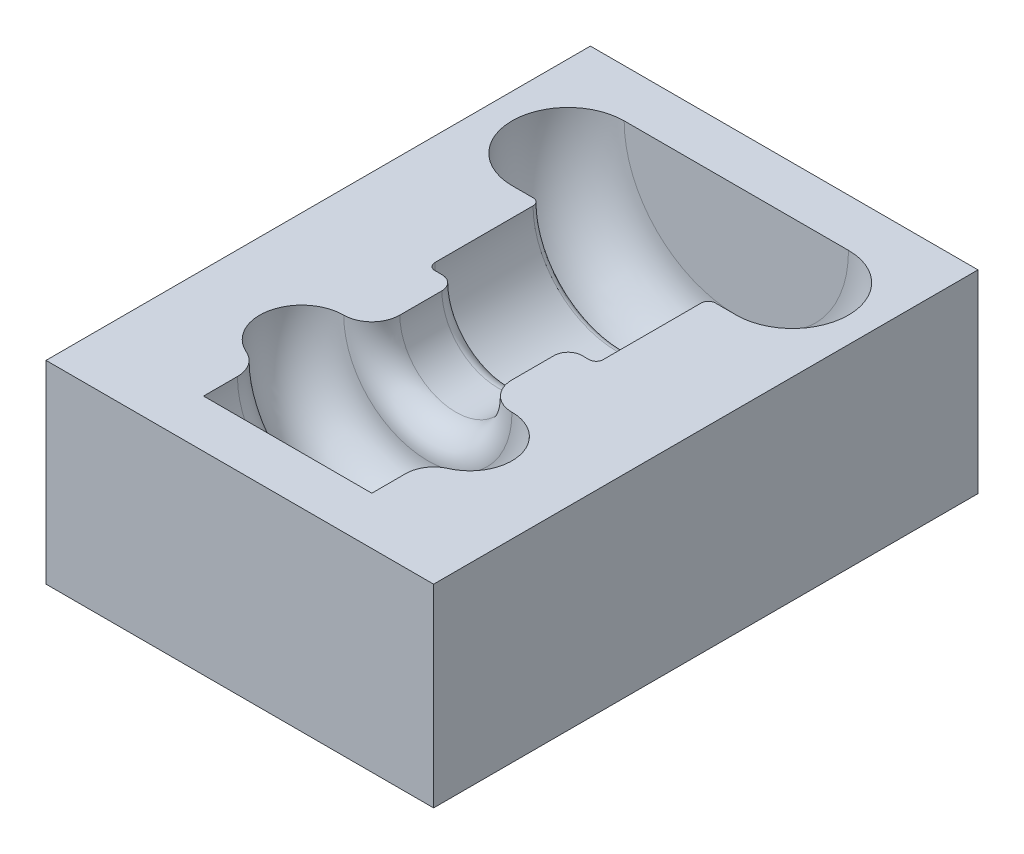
ISO-10303-21;
HEADER;
FILE_DESCRIPTION(('STEP AP214'),'2;1');
FILE_NAME('part.step','',(''),(''),'','','');
FILE_SCHEMA(('AUTOMOTIVE_DESIGN { 1 0 10303 214 1 1 1 1 }'));
ENDSEC;
DATA;
#1=APPLICATION_CONTEXT('core data for automotive mechanical design processes');
#2=APPLICATION_PROTOCOL_DEFINITION('international standard','automotive_design',2000,#1);
#3=PRODUCT_CONTEXT('',#1,'mechanical');
#4=PRODUCT('Part','Part','',(#3));
#5=PRODUCT_RELATED_PRODUCT_CATEGORY('part','',(#4));
#6=PRODUCT_DEFINITION_FORMATION('','',#4);
#7=PRODUCT_DEFINITION_CONTEXT('part definition',#1,'design');
#8=PRODUCT_DEFINITION('design','',#6,#7);
#9=PRODUCT_DEFINITION_SHAPE('','',#8);
#10=(LENGTH_UNIT() NAMED_UNIT(*) SI_UNIT(.MILLI.,.METRE.));
#11=(NAMED_UNIT(*) PLANE_ANGLE_UNIT() SI_UNIT($,.RADIAN.));
#12=(NAMED_UNIT(*) SI_UNIT($,.STERADIAN.) SOLID_ANGLE_UNIT());
#13=UNCERTAINTY_MEASURE_WITH_UNIT(LENGTH_MEASURE(1.E-05),#10,'distance_accuracy_value','');
#14=(GEOMETRIC_REPRESENTATION_CONTEXT(3) GLOBAL_UNCERTAINTY_ASSIGNED_CONTEXT((#13)) GLOBAL_UNIT_ASSIGNED_CONTEXT((#10,
#11,#12)) REPRESENTATION_CONTEXT('',''));
#15=CARTESIAN_POINT('',(0.,0.,0.));
#16=DIRECTION('',(0.,0.,1.));
#17=DIRECTION('',(1.,0.,0.));
#18=AXIS2_PLACEMENT_3D('',#15,#16,#17);
#19=CARTESIAN_POINT('',(-71.2,0.,-100.01));
#20=DIRECTION('',(0.,-1.,0.));
#21=DIRECTION('',(0.,0.,-1.));
#22=AXIS2_PLACEMENT_3D('',#19,#20,#21);
#23=PLANE('',#22);
#24=DIRECTION('',(-1.,0.,0.));
#25=VECTOR('',#24,1.);
#26=CARTESIAN_POINT('',(0.,0.,-100.));
#27=LINE('',#26,#25);
#28=CARTESIAN_POINT('',(71.2,0.,-100.));
#29=VERTEX_POINT('',#28);
#30=CARTESIAN_POINT('',(-71.2,0.,-100.));
#31=VERTEX_POINT('',#30);
#32=EDGE_CURVE('E35',#29,#31,#27,.T.);
#33=ORIENTED_EDGE('',*,*,#32,.T.);
#34=DIRECTION('',(0.,0.,-1.));
#35=VECTOR('',#34,1.);
#36=CARTESIAN_POINT('',(-71.2,0.,100.));
#37=LINE('',#36,#35);
#38=CARTESIAN_POINT('',(-71.2,0.,100.));
#39=VERTEX_POINT('',#38);
#40=EDGE_CURVE('E191',#39,#31,#37,.T.);
#41=ORIENTED_EDGE('',*,*,#40,.F.);
#42=DIRECTION('',(-1.,0.,0.));
#43=VECTOR('',#42,1.);
#44=CARTESIAN_POINT('',(0.,0.,100.));
#45=LINE('',#44,#43);
#46=CARTESIAN_POINT('',(71.2,0.,100.));
#47=VERTEX_POINT('',#46);
#48=EDGE_CURVE('E159',#47,#39,#45,.T.);
#49=ORIENTED_EDGE('',*,*,#48,.F.);
#50=DIRECTION('',(0.,0.,1.));
#51=VECTOR('',#50,1.);
#52=CARTESIAN_POINT('',(71.2,0.,100.));
#53=LINE('',#52,#51);
#54=EDGE_CURVE('E194',#29,#47,#53,.T.);
#55=ORIENTED_EDGE('',*,*,#54,.F.);
#56=EDGE_LOOP('',(#33,#41,#49,#55));
#57=FACE_BOUND('',#56,.T.);
#58=CARTESIAN_POINT('',(41.208,0.,-61.812));
#59=DIRECTION('',(0.,-1.,0.));
#60=DIRECTION('',(0.,0.,-1.));
#61=AXIS2_PLACEMENT_3D('',#58,#59,#60);
#62=CIRCLE('',#61,20.604);
#63=CARTESIAN_POINT('',(41.208,0.,-82.416));
#64=VERTEX_POINT('',#63);
#65=CARTESIAN_POINT('',(41.208,0.,-41.208));
#66=VERTEX_POINT('',#65);
#67=EDGE_CURVE('E231',#64,#66,#62,.T.);
#68=ORIENTED_EDGE('',*,*,#67,.T.);
#69=DIRECTION('',(-1.,0.,0.));
#70=VECTOR('',#69,1.);
#71=CARTESIAN_POINT('',(0.,0.,-41.208));
#72=LINE('',#71,#70);
#73=CARTESIAN_POINT('',(33.4815,0.,-41.208));
#74=VERTEX_POINT('',#73);
#75=EDGE_CURVE('E227',#66,#74,#72,.T.);
#76=ORIENTED_EDGE('',*,*,#75,.T.);
#77=CARTESIAN_POINT('',(33.4815,0.,-38.6325));
#78=DIRECTION('',(0.,-1.,0.));
#79=DIRECTION('',(0.,0.,-1.));
#80=AXIS2_PLACEMENT_3D('',#77,#78,#79);
#81=CIRCLE('',#80,2.5755);
#82=CARTESIAN_POINT('',(30.906,0.,-38.6325));
#83=VERTEX_POINT('',#82);
#84=EDGE_CURVE('E192',#83,#74,#81,.T.);
#85=ORIENTED_EDGE('',*,*,#84,.F.);
#86=DIRECTION('',(0.,0.,1.));
#87=VECTOR('',#86,1.);
#88=CARTESIAN_POINT('',(30.906,0.,82.416));
#89=LINE('',#88,#87);
#90=CARTESIAN_POINT('',(30.906,0.,-2.57550000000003));
#91=VERTEX_POINT('',#90);
#92=EDGE_CURVE('E221',#91,#83,#89,.F.);
#93=ORIENTED_EDGE('',*,*,#92,.F.);
#94=CARTESIAN_POINT('',(28.3305,0.,-2.57550000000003));
#95=DIRECTION('',(0.,-1.,0.));
#96=DIRECTION('',(0.,0.,-1.));
#97=AXIS2_PLACEMENT_3D('',#94,#95,#96);
#98=CIRCLE('',#97,2.5755);
#99=CARTESIAN_POINT('',(28.3305,0.,0.));
#100=VERTEX_POINT('',#99);
#101=EDGE_CURVE('E218',#91,#100,#98,.T.);
#102=ORIENTED_EDGE('',*,*,#101,.T.);
#103=DIRECTION('',(-1.,0.,0.));
#104=VECTOR('',#103,1.);
#105=CARTESIAN_POINT('',(0.,0.,0.));
#106=LINE('',#105,#104);
#107=CARTESIAN_POINT('',(25.755,0.,0.));
#108=VERTEX_POINT('',#107);
#109=EDGE_CURVE('E214',#100,#108,#106,.T.);
#110=ORIENTED_EDGE('',*,*,#109,.T.);
#111=CARTESIAN_POINT('',(25.755,0.,5.15099999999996));
#112=DIRECTION('',(0.,-1.,0.));
#113=DIRECTION('',(0.,0.,-1.));
#114=AXIS2_PLACEMENT_3D('',#111,#112,#113);
#115=CIRCLE('',#114,5.151);
#116=CARTESIAN_POINT('',(20.604,0.,5.15099999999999));
#117=VERTEX_POINT('',#116);
#118=EDGE_CURVE('E210',#117,#108,#115,.T.);
#119=ORIENTED_EDGE('',*,*,#118,.F.);
#120=DIRECTION('',(0.,0.,1.));
#121=VECTOR('',#120,1.);
#122=CARTESIAN_POINT('',(20.604,0.,82.416));
#123=LINE('',#122,#121);
#124=CARTESIAN_POINT('',(20.604,0.,20.604));
#125=VERTEX_POINT('',#124);
#126=EDGE_CURVE('E207',#117,#125,#123,.T.);
#127=ORIENTED_EDGE('',*,*,#126,.T.);
#128=CARTESIAN_POINT('',(30.906,0.,20.604));
#129=DIRECTION('',(0.,-1.,0.));
#130=DIRECTION('',(0.,0.,-1.));
#131=AXIS2_PLACEMENT_3D('',#128,#129,#130);
#132=CIRCLE('',#131,10.302);
#133=CARTESIAN_POINT('',(30.906,0.,30.906));
#134=VERTEX_POINT('',#133);
#135=EDGE_CURVE('E203',#134,#125,#132,.T.);
#136=ORIENTED_EDGE('',*,*,#135,.F.);
#137=CARTESIAN_POINT('',(30.906,0.,46.359));
#138=DIRECTION('',(0.,-1.,0.));
#139=DIRECTION('',(0.,0.,-1.));
#140=AXIS2_PLACEMENT_3D('',#137,#138,#139);
#141=CIRCLE('',#140,15.453);
#142=CARTESIAN_POINT('',(37.0872,0.,60.5219084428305));
#143=VERTEX_POINT('',#142);
#144=EDGE_CURVE('E200',#134,#143,#141,.T.);
#145=ORIENTED_EDGE('',*,*,#144,.T.);
#146=CARTESIAN_POINT('',(41.208,0.,69.9638474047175));
#147=DIRECTION('',(0.,-1.,0.));
#148=DIRECTION('',(0.,0.,-1.));
#149=AXIS2_PLACEMENT_3D('',#146,#147,#148);
#150=CIRCLE('',#149,10.302);
#151=CARTESIAN_POINT('',(30.906,0.,69.9638474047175));
#152=VERTEX_POINT('',#151);
#153=EDGE_CURVE('E197',#152,#143,#150,.T.);
#154=ORIENTED_EDGE('',*,*,#153,.F.);
#155=DIRECTION('',(0.,0.,1.));
#156=VECTOR('',#155,1.);
#157=CARTESIAN_POINT('',(30.906,0.,82.416));
#158=LINE('',#157,#156);
#159=CARTESIAN_POINT('',(30.906,0.,82.416));
#160=VERTEX_POINT('',#159);
#161=EDGE_CURVE('E40',#152,#160,#158,.T.);
#162=ORIENTED_EDGE('',*,*,#161,.T.);
#163=DIRECTION('',(-1.,0.,0.));
#164=VECTOR('',#163,1.);
#165=CARTESIAN_POINT('',(0.,0.,82.416));
#166=LINE('',#165,#164);
#167=CARTESIAN_POINT('',(-30.906,0.,82.416));
#168=VERTEX_POINT('',#167);
#169=EDGE_CURVE('E47',#160,#168,#166,.T.);
#170=ORIENTED_EDGE('',*,*,#169,.T.);
#171=DIRECTION('',(0.,0.,1.));
#172=VECTOR('',#171,1.);
#173=CARTESIAN_POINT('',(-30.906,0.,82.416));
#174=LINE('',#173,#172);
#175=CARTESIAN_POINT('',(-30.906,0.,69.9638474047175));
#176=VERTEX_POINT('',#175);
#177=EDGE_CURVE('E11',#168,#176,#174,.F.);
#178=ORIENTED_EDGE('',*,*,#177,.T.);
#179=CARTESIAN_POINT('',(-41.208,0.,69.9638474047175));
#180=DIRECTION('',(0.,-1.,0.));
#181=DIRECTION('',(0.,0.,-1.));
#182=AXIS2_PLACEMENT_3D('',#179,#180,#181);
#183=CIRCLE('',#182,10.302);
#184=CARTESIAN_POINT('',(-37.0872,0.,60.5219084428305));
#185=VERTEX_POINT('',#184);
#186=EDGE_CURVE('E171',#185,#176,#183,.T.);
#187=ORIENTED_EDGE('',*,*,#186,.F.);
#188=CARTESIAN_POINT('',(-30.906,0.,46.359));
#189=DIRECTION('',(0.,-1.,0.));
#190=DIRECTION('',(0.,0.,-1.));
#191=AXIS2_PLACEMENT_3D('',#188,#189,#190);
#192=CIRCLE('',#191,15.453);
#193=CARTESIAN_POINT('',(-30.906,0.,30.906));
#194=VERTEX_POINT('',#193);
#195=EDGE_CURVE('E189',#185,#194,#192,.T.);
#196=ORIENTED_EDGE('',*,*,#195,.T.);
#197=CARTESIAN_POINT('',(-30.906,0.,20.604));
#198=DIRECTION('',(0.,-1.,0.));
#199=DIRECTION('',(0.,0.,-1.));
#200=AXIS2_PLACEMENT_3D('',#197,#198,#199);
#201=CIRCLE('',#200,10.302);
#202=CARTESIAN_POINT('',(-20.604,0.,20.604));
#203=VERTEX_POINT('',#202);
#204=EDGE_CURVE('E201',#203,#194,#201,.T.);
#205=ORIENTED_EDGE('',*,*,#204,.F.);
#206=DIRECTION('',(0.,0.,1.));
#207=VECTOR('',#206,1.);
#208=CARTESIAN_POINT('',(-20.604,0.,82.416));
#209=LINE('',#208,#207);
#210=CARTESIAN_POINT('',(-20.604,0.,5.15099999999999));
#211=VERTEX_POINT('',#210);
#212=EDGE_CURVE('E204',#203,#211,#209,.F.);
#213=ORIENTED_EDGE('',*,*,#212,.T.);
#214=CARTESIAN_POINT('',(-25.755,0.,5.15099999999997));
#215=DIRECTION('',(0.,-1.,0.));
#216=DIRECTION('',(0.,0.,-1.));
#217=AXIS2_PLACEMENT_3D('',#214,#215,#216);
#218=CIRCLE('',#217,5.151);
#219=CARTESIAN_POINT('',(-25.755,0.,0.));
#220=VERTEX_POINT('',#219);
#221=EDGE_CURVE('E208',#220,#211,#218,.T.);
#222=ORIENTED_EDGE('',*,*,#221,.F.);
#223=CARTESIAN_POINT('',(-28.3305,0.,0.));
#224=VERTEX_POINT('',#223);
#225=EDGE_CURVE('E211',#220,#224,#106,.T.);
#226=ORIENTED_EDGE('',*,*,#225,.T.);
#227=CARTESIAN_POINT('',(-28.3305,0.,-2.57550000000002));
#228=DIRECTION('',(0.,-1.,0.));
#229=DIRECTION('',(0.,0.,-1.));
#230=AXIS2_PLACEMENT_3D('',#227,#228,#229);
#231=CIRCLE('',#230,2.5755);
#232=CARTESIAN_POINT('',(-30.906,0.,-2.57550000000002));
#233=VERTEX_POINT('',#232);
#234=EDGE_CURVE('E215',#224,#233,#231,.T.);
#235=ORIENTED_EDGE('',*,*,#234,.T.);
#236=DIRECTION('',(0.,0.,1.));
#237=VECTOR('',#236,1.);
#238=CARTESIAN_POINT('',(-30.906,0.,82.416));
#239=LINE('',#238,#237);
#240=CARTESIAN_POINT('',(-30.906,0.,-38.6325));
#241=VERTEX_POINT('',#240);
#242=EDGE_CURVE('E219',#241,#233,#239,.T.);
#243=ORIENTED_EDGE('',*,*,#242,.F.);
#244=CARTESIAN_POINT('',(-33.4815,0.,-38.6325));
#245=DIRECTION('',(0.,-1.,0.));
#246=DIRECTION('',(0.,0.,-1.));
#247=AXIS2_PLACEMENT_3D('',#244,#245,#246);
#248=CIRCLE('',#247,2.5755);
#249=CARTESIAN_POINT('',(-33.4815,0.,-41.208));
#250=VERTEX_POINT('',#249);
#251=EDGE_CURVE('E222',#250,#241,#248,.T.);
#252=ORIENTED_EDGE('',*,*,#251,.F.);
#253=CARTESIAN_POINT('',(-41.208,0.,-41.208));
#254=VERTEX_POINT('',#253);
#255=EDGE_CURVE('E224',#250,#254,#72,.T.);
#256=ORIENTED_EDGE('',*,*,#255,.T.);
#257=CARTESIAN_POINT('',(-41.208,0.,-61.812));
#258=DIRECTION('',(0.,-1.,0.));
#259=DIRECTION('',(0.,0.,-1.));
#260=AXIS2_PLACEMENT_3D('',#257,#258,#259);
#261=CIRCLE('',#260,20.604);
#262=CARTESIAN_POINT('',(-41.208,0.,-82.416));
#263=VERTEX_POINT('',#262);
#264=EDGE_CURVE('E228',#254,#263,#261,.T.);
#265=ORIENTED_EDGE('',*,*,#264,.T.);
#266=DIRECTION('',(1.,0.,0.));
#267=VECTOR('',#266,1.);
#268=CARTESIAN_POINT('',(0.,0.,-82.416));
#269=LINE('',#268,#267);
#270=EDGE_CURVE('E232',#263,#64,#269,.T.);
#271=ORIENTED_EDGE('',*,*,#270,.T.);
#272=EDGE_LOOP('',(#68,#76,#85,#93,#102,#110,#119,#127,#136,#145,#154,#162,#170,#178,#187,#196,
#205,#213,#222,#226,#235,#243,#252,#256,#265,#271));
#273=FACE_BOUND('',#272,.T.);
#274=ADVANCED_FACE('F32',(#57,#273),#23,.F.);
#275=CARTESIAN_POINT('',(0.,0.,82.416));
#276=DIRECTION('',(0.,0.,-1.));
#277=DIRECTION('',(-1.,0.,0.));
#278=AXIS2_PLACEMENT_3D('',#275,#276,#277);
#279=PLANE('',#278);
#280=ORIENTED_EDGE('',*,*,#169,.F.);
#281=CARTESIAN_POINT('',(0.,0.,82.416));
#282=DIRECTION('',(0.,0.,1.));
#283=DIRECTION('',(1.,0.,0.));
#284=AXIS2_PLACEMENT_3D('',#281,#282,#283);
#285=CIRCLE('',#284,30.906);
#286=EDGE_CURVE('E342',#168,#160,#285,.T.);
#287=ORIENTED_EDGE('',*,*,#286,.F.);
#288=EDGE_LOOP('',(#280,#287));
#289=FACE_BOUND('',#288,.T.);
#290=ADVANCED_FACE('F281',(#289),#279,.T.);
#291=CARTESIAN_POINT('',(0.,0.,-82.416));
#292=DIRECTION('',(0.,0.,1.));
#293=DIRECTION('',(1.,0.,0.));
#294=AXIS2_PLACEMENT_3D('',#291,#292,#293);
#295=PLANE('',#294);
#296=ORIENTED_EDGE('',*,*,#270,.F.);
#297=CARTESIAN_POINT('',(0.,0.,-82.416));
#298=DIRECTION('',(0.,0.,1.));
#299=DIRECTION('',(1.,0.,0.));
#300=AXIS2_PLACEMENT_3D('',#297,#298,#299);
#301=CIRCLE('',#300,41.208);
#302=EDGE_CURVE('E184',#263,#64,#301,.T.);
#303=ORIENTED_EDGE('',*,*,#302,.T.);
#304=EDGE_LOOP('',(#296,#303));
#305=FACE_BOUND('',#304,.T.);
#306=ADVANCED_FACE('F285',(#305),#295,.T.);
#307=CARTESIAN_POINT('',(0.,0.,-61.812));
#308=DIRECTION('',(0.,0.,1.));
#309=DIRECTION('',(1.,0.,0.));
#310=AXIS2_PLACEMENT_3D('',#307,#308,#309);
#311=TOROIDAL_SURFACE('',#310,41.208,20.604);
#312=ORIENTED_EDGE('',*,*,#67,.F.);
#313=ORIENTED_EDGE('',*,*,#302,.F.);
#314=ORIENTED_EDGE('',*,*,#264,.F.);
#315=CARTESIAN_POINT('',(0.,0.,-41.208));
#316=DIRECTION('',(0.,0.,1.));
#317=DIRECTION('',(1.,0.,0.));
#318=AXIS2_PLACEMENT_3D('',#315,#316,#317);
#319=CIRCLE('',#318,41.208);
#320=EDGE_CURVE('E256',#254,#66,#319,.T.);
#321=ORIENTED_EDGE('',*,*,#320,.T.);
#322=EDGE_LOOP('',(#312,#313,#314,#321));
#323=FACE_BOUND('',#322,.T.);
#324=ADVANCED_FACE('F257',(#323),#311,.F.);
#325=CARTESIAN_POINT('',(0.,0.,-41.208));
#326=DIRECTION('',(0.,0.,-1.));
#327=DIRECTION('',(-1.,0.,0.));
#328=AXIS2_PLACEMENT_3D('',#325,#326,#327);
#329=PLANE('',#328);
#330=ORIENTED_EDGE('',*,*,#75,.F.);
#331=ORIENTED_EDGE('',*,*,#320,.F.);
#332=ORIENTED_EDGE('',*,*,#255,.F.);
#333=CARTESIAN_POINT('',(0.,0.,-41.208));
#334=DIRECTION('',(0.,0.,1.));
#335=DIRECTION('',(1.,0.,0.));
#336=AXIS2_PLACEMENT_3D('',#333,#334,#335);
#337=CIRCLE('',#336,33.4815);
#338=EDGE_CURVE('E259',#250,#74,#337,.T.);
#339=ORIENTED_EDGE('',*,*,#338,.T.);
#340=EDGE_LOOP('',(#330,#331,#332,#339));
#341=FACE_BOUND('',#340,.T.);
#342=ADVANCED_FACE('F295',(#341),#329,.T.);
#343=CARTESIAN_POINT('',(0.,0.,-38.6325));
#344=DIRECTION('',(0.,0.,1.));
#345=DIRECTION('',(1.,0.,0.));
#346=AXIS2_PLACEMENT_3D('',#343,#344,#345);
#347=TOROIDAL_SURFACE('',#346,33.4815,2.5755);
#348=CARTESIAN_POINT('',(0.,0.,-38.6325));
#349=DIRECTION('',(0.,0.,1.));
#350=DIRECTION('',(1.,0.,0.));
#351=AXIS2_PLACEMENT_3D('',#348,#349,#350);
#352=CIRCLE('',#351,30.906);
#353=EDGE_CURVE('E262',#241,#83,#352,.T.);
#354=ORIENTED_EDGE('',*,*,#353,.T.);
#355=ORIENTED_EDGE('',*,*,#84,.T.);
#356=ORIENTED_EDGE('',*,*,#338,.F.);
#357=ORIENTED_EDGE('',*,*,#251,.T.);
#358=EDGE_LOOP('',(#354,#355,#356,#357));
#359=FACE_BOUND('',#358,.T.);
#360=ADVANCED_FACE('F298',(#359),#347,.T.);
#361=CARTESIAN_POINT('',(0.,0.,82.416));
#362=DIRECTION('',(0.,0.,1.));
#363=DIRECTION('',(1.,0.,0.));
#364=AXIS2_PLACEMENT_3D('',#361,#362,#363);
#365=CYLINDRICAL_SURFACE('',#364,30.906);
#366=CARTESIAN_POINT('',(0.,0.,-2.57550000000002));
#367=DIRECTION('',(0.,0.,1.));
#368=DIRECTION('',(1.,0.,0.));
#369=AXIS2_PLACEMENT_3D('',#366,#367,#368);
#370=CIRCLE('',#369,30.906);
#371=EDGE_CURVE('E367',#233,#91,#370,.T.);
#372=ORIENTED_EDGE('',*,*,#371,.T.);
#373=ORIENTED_EDGE('',*,*,#92,.T.);
#374=ORIENTED_EDGE('',*,*,#353,.F.);
#375=ORIENTED_EDGE('',*,*,#242,.T.);
#376=EDGE_LOOP('',(#372,#373,#374,#375));
#377=FACE_BOUND('',#376,.T.);
#378=ADVANCED_FACE('F301',(#377),#365,.F.);
#379=CARTESIAN_POINT('',(0.,0.,-2.57550000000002));
#380=DIRECTION('',(0.,0.,1.));
#381=DIRECTION('',(1.,0.,0.));
#382=AXIS2_PLACEMENT_3D('',#379,#380,#381);
#383=TOROIDAL_SURFACE('',#382,28.3305,2.5755);
#384=ORIENTED_EDGE('',*,*,#101,.F.);
#385=ORIENTED_EDGE('',*,*,#371,.F.);
#386=ORIENTED_EDGE('',*,*,#234,.F.);
#387=CARTESIAN_POINT('',(0.,0.,0.));
#388=DIRECTION('',(0.,0.,1.));
#389=DIRECTION('',(1.,0.,0.));
#390=AXIS2_PLACEMENT_3D('',#387,#388,#389);
#391=CIRCLE('',#390,28.3305);
#392=EDGE_CURVE('E364',#224,#100,#391,.T.);
#393=ORIENTED_EDGE('',*,*,#392,.T.);
#394=EDGE_LOOP('',(#384,#385,#386,#393));
#395=FACE_BOUND('',#394,.T.);
#396=ADVANCED_FACE('F305',(#395),#383,.F.);
#397=CARTESIAN_POINT('',(0.,0.,0.));
#398=DIRECTION('',(0.,0.,-1.));
#399=DIRECTION('',(-1.,0.,0.));
#400=AXIS2_PLACEMENT_3D('',#397,#398,#399);
#401=PLANE('',#400);
#402=ORIENTED_EDGE('',*,*,#109,.F.);
#403=ORIENTED_EDGE('',*,*,#392,.F.);
#404=ORIENTED_EDGE('',*,*,#225,.F.);
#405=CARTESIAN_POINT('',(0.,0.,0.));
#406=DIRECTION('',(0.,0.,1.));
#407=DIRECTION('',(1.,0.,0.));
#408=AXIS2_PLACEMENT_3D('',#405,#406,#407);
#409=CIRCLE('',#408,25.755);
#410=EDGE_CURVE('E361',#220,#108,#409,.T.);
#411=ORIENTED_EDGE('',*,*,#410,.T.);
#412=EDGE_LOOP('',(#402,#403,#404,#411));
#413=FACE_BOUND('',#412,.T.);
#414=ADVANCED_FACE('F309',(#413),#401,.T.);
#415=CARTESIAN_POINT('',(0.,0.,5.15099999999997));
#416=DIRECTION('',(0.,0.,1.));
#417=DIRECTION('',(1.,0.,0.));
#418=AXIS2_PLACEMENT_3D('',#415,#416,#417);
#419=TOROIDAL_SURFACE('',#418,25.755,5.151);
#420=CARTESIAN_POINT('',(0.,0.,5.15099999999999));
#421=DIRECTION('',(0.,0.,1.));
#422=DIRECTION('',(1.,0.,0.));
#423=AXIS2_PLACEMENT_3D('',#420,#421,#422);
#424=CIRCLE('',#423,20.604);
#425=EDGE_CURVE('E358',#211,#117,#424,.T.);
#426=ORIENTED_EDGE('',*,*,#425,.T.);
#427=ORIENTED_EDGE('',*,*,#118,.T.);
#428=ORIENTED_EDGE('',*,*,#410,.F.);
#429=ORIENTED_EDGE('',*,*,#221,.T.);
#430=EDGE_LOOP('',(#426,#427,#428,#429));
#431=FACE_BOUND('',#430,.T.);
#432=ADVANCED_FACE('F313',(#431),#419,.T.);
#433=CARTESIAN_POINT('',(0.,0.,82.416));
#434=DIRECTION('',(0.,0.,1.));
#435=DIRECTION('',(1.,0.,0.));
#436=AXIS2_PLACEMENT_3D('',#433,#434,#435);
#437=CYLINDRICAL_SURFACE('',#436,20.604);
#438=ORIENTED_EDGE('',*,*,#126,.F.);
#439=ORIENTED_EDGE('',*,*,#425,.F.);
#440=ORIENTED_EDGE('',*,*,#212,.F.);
#441=CARTESIAN_POINT('',(0.,0.,20.604));
#442=DIRECTION('',(0.,0.,1.));
#443=DIRECTION('',(1.,0.,0.));
#444=AXIS2_PLACEMENT_3D('',#441,#442,#443);
#445=CIRCLE('',#444,20.604);
#446=EDGE_CURVE('E355',#203,#125,#445,.T.);
#447=ORIENTED_EDGE('',*,*,#446,.T.);
#448=EDGE_LOOP('',(#438,#439,#440,#447));
#449=FACE_BOUND('',#448,.T.);
#450=ADVANCED_FACE('F317',(#449),#437,.F.);
#451=CARTESIAN_POINT('',(0.,0.,20.604));
#452=DIRECTION('',(0.,0.,1.));
#453=DIRECTION('',(1.,0.,0.));
#454=AXIS2_PLACEMENT_3D('',#451,#452,#453);
#455=TOROIDAL_SURFACE('',#454,30.906,10.302);
#456=CARTESIAN_POINT('',(0.,0.,30.906));
#457=DIRECTION('',(0.,0.,1.));
#458=DIRECTION('',(1.,0.,0.));
#459=AXIS2_PLACEMENT_3D('',#456,#457,#458);
#460=CIRCLE('',#459,30.906);
#461=EDGE_CURVE('E349',#194,#134,#460,.T.);
#462=ORIENTED_EDGE('',*,*,#461,.T.);
#463=ORIENTED_EDGE('',*,*,#135,.T.);
#464=ORIENTED_EDGE('',*,*,#446,.F.);
#465=ORIENTED_EDGE('',*,*,#204,.T.);
#466=EDGE_LOOP('',(#462,#463,#464,#465));
#467=FACE_BOUND('',#466,.T.);
#468=ADVANCED_FACE('F321',(#467),#455,.T.);
#469=CARTESIAN_POINT('',(0.,0.,46.359));
#470=DIRECTION('',(0.,0.,1.));
#471=DIRECTION('',(1.,0.,0.));
#472=AXIS2_PLACEMENT_3D('',#469,#470,#471);
#473=TOROIDAL_SURFACE('',#472,30.906,15.453);
#474=ORIENTED_EDGE('',*,*,#144,.F.);
#475=ORIENTED_EDGE('',*,*,#461,.F.);
#476=ORIENTED_EDGE('',*,*,#195,.F.);
#477=CARTESIAN_POINT('',(0.,0.,60.5219084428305));
#478=DIRECTION('',(0.,0.,1.));
#479=DIRECTION('',(1.,0.,0.));
#480=AXIS2_PLACEMENT_3D('',#477,#478,#479);
#481=CIRCLE('',#480,37.0872);
#482=EDGE_CURVE('E347',#185,#143,#481,.T.);
#483=ORIENTED_EDGE('',*,*,#482,.T.);
#484=EDGE_LOOP('',(#474,#475,#476,#483));
#485=FACE_BOUND('',#484,.T.);
#486=ADVANCED_FACE('F325',(#485),#473,.F.);
#487=CARTESIAN_POINT('',(0.,0.,69.9638474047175));
#488=DIRECTION('',(0.,0.,1.));
#489=DIRECTION('',(1.,0.,0.));
#490=AXIS2_PLACEMENT_3D('',#487,#488,#489);
#491=TOROIDAL_SURFACE('',#490,41.208,10.302);
#492=CARTESIAN_POINT('',(0.,0.,69.9638474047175));
#493=DIRECTION('',(0.,0.,1.));
#494=DIRECTION('',(1.,0.,0.));
#495=AXIS2_PLACEMENT_3D('',#492,#493,#494);
#496=CIRCLE('',#495,30.906);
#497=EDGE_CURVE('E341',#176,#152,#496,.T.);
#498=ORIENTED_EDGE('',*,*,#497,.T.);
#499=ORIENTED_EDGE('',*,*,#153,.T.);
#500=ORIENTED_EDGE('',*,*,#482,.F.);
#501=ORIENTED_EDGE('',*,*,#186,.T.);
#502=EDGE_LOOP('',(#498,#499,#500,#501));
#503=FACE_BOUND('',#502,.T.);
#504=ADVANCED_FACE('F329',(#503),#491,.T.);
#505=CARTESIAN_POINT('',(0.,0.,82.416));
#506=DIRECTION('',(0.,0.,1.));
#507=DIRECTION('',(1.,0.,0.));
#508=AXIS2_PLACEMENT_3D('',#505,#506,#507);
#509=CYLINDRICAL_SURFACE('',#508,30.906);
#510=ORIENTED_EDGE('',*,*,#161,.F.);
#511=ORIENTED_EDGE('',*,*,#497,.F.);
#512=ORIENTED_EDGE('',*,*,#177,.F.);
#513=ORIENTED_EDGE('',*,*,#286,.T.);
#514=EDGE_LOOP('',(#510,#511,#512,#513));
#515=FACE_BOUND('',#514,.T.);
#516=ADVANCED_FACE('F333',(#515),#509,.F.);
#517=CARTESIAN_POINT('',(71.2,-71.2,100.));
#518=DIRECTION('',(-1.,0.,0.));
#519=DIRECTION('',(0.,0.,1.));
#520=AXIS2_PLACEMENT_3D('',#517,#518,#519);
#521=PLANE('',#520);
#522=DIRECTION('',(0.,1.,0.));
#523=VECTOR('',#522,1.);
#524=CARTESIAN_POINT('',(71.2,-71.2,-100.));
#525=LINE('',#524,#523);
#526=CARTESIAN_POINT('',(71.2,-71.2,-100.));
#527=VERTEX_POINT('',#526);
#528=EDGE_CURVE('E181',#527,#29,#525,.T.);
#529=ORIENTED_EDGE('',*,*,#528,.T.);
#530=ORIENTED_EDGE('',*,*,#54,.T.);
#531=DIRECTION('',(0.,1.,0.));
#532=VECTOR('',#531,1.);
#533=CARTESIAN_POINT('',(71.2,-71.2,100.));
#534=LINE('',#533,#532);
#535=CARTESIAN_POINT('',(71.2,-71.2,100.));
#536=VERTEX_POINT('',#535);
#537=EDGE_CURVE('E162',#536,#47,#534,.T.);
#538=ORIENTED_EDGE('',*,*,#537,.F.);
#539=DIRECTION('',(0.,0.,-1.));
#540=VECTOR('',#539,1.);
#541=CARTESIAN_POINT('',(71.2,-71.2,100.));
#542=LINE('',#541,#540);
#543=EDGE_CURVE('E172',#536,#527,#542,.T.);
#544=ORIENTED_EDGE('',*,*,#543,.T.);
#545=EDGE_LOOP('',(#529,#530,#538,#544));
#546=FACE_BOUND('',#545,.T.);
#547=ADVANCED_FACE('F266',(#546),#521,.F.);
#548=CARTESIAN_POINT('',(-71.2,-71.2,100.));
#549=DIRECTION('',(1.,0.,0.));
#550=DIRECTION('',(0.,0.,-1.));
#551=AXIS2_PLACEMENT_3D('',#548,#549,#550);
#552=PLANE('',#551);
#553=DIRECTION('',(0.,-1.,0.));
#554=VECTOR('',#553,1.);
#555=CARTESIAN_POINT('',(-71.2,-71.2,100.));
#556=LINE('',#555,#554);
#557=CARTESIAN_POINT('',(-71.2,-71.2,100.));
#558=VERTEX_POINT('',#557);
#559=EDGE_CURVE('E151',#39,#558,#556,.T.);
#560=ORIENTED_EDGE('',*,*,#559,.F.);
#561=ORIENTED_EDGE('',*,*,#40,.T.);
#562=DIRECTION('',(0.,-1.,0.));
#563=VECTOR('',#562,1.);
#564=CARTESIAN_POINT('',(-71.2,-71.2,-100.));
#565=LINE('',#564,#563);
#566=CARTESIAN_POINT('',(-71.2,-71.2,-100.));
#567=VERTEX_POINT('',#566);
#568=EDGE_CURVE('E168',#31,#567,#565,.T.);
#569=ORIENTED_EDGE('',*,*,#568,.T.);
#570=DIRECTION('',(0.,0.,-1.));
#571=VECTOR('',#570,1.);
#572=CARTESIAN_POINT('',(-71.2,-71.2,100.));
#573=LINE('',#572,#571);
#574=EDGE_CURVE('E165',#558,#567,#573,.T.);
#575=ORIENTED_EDGE('',*,*,#574,.F.);
#576=EDGE_LOOP('',(#560,#561,#569,#575));
#577=FACE_BOUND('',#576,.T.);
#578=ADVANCED_FACE('F166',(#577),#552,.F.);
#579=CARTESIAN_POINT('',(-71.2,-71.2,100.));
#580=DIRECTION('',(0.,1.,0.));
#581=DIRECTION('',(0.,0.,1.));
#582=AXIS2_PLACEMENT_3D('',#579,#580,#581);
#583=PLANE('',#582);
#584=DIRECTION('',(1.,0.,0.));
#585=VECTOR('',#584,1.);
#586=CARTESIAN_POINT('',(-71.2,-71.2,-100.));
#587=LINE('',#586,#585);
#588=EDGE_CURVE('E186',#567,#527,#587,.T.);
#589=ORIENTED_EDGE('',*,*,#588,.T.);
#590=ORIENTED_EDGE('',*,*,#543,.F.);
#591=DIRECTION('',(1.,0.,0.));
#592=VECTOR('',#591,1.);
#593=CARTESIAN_POINT('',(-71.2,-71.2,100.));
#594=LINE('',#593,#592);
#595=EDGE_CURVE('E156',#558,#536,#594,.T.);
#596=ORIENTED_EDGE('',*,*,#595,.F.);
#597=ORIENTED_EDGE('',*,*,#574,.T.);
#598=EDGE_LOOP('',(#589,#590,#596,#597));
#599=FACE_BOUND('',#598,.T.);
#600=ADVANCED_FACE('F174',(#599),#583,.F.);
#601=CARTESIAN_POINT('',(0.,0.,100.));
#602=DIRECTION('',(0.,0.,-1.));
#603=DIRECTION('',(-1.,0.,0.));
#604=AXIS2_PLACEMENT_3D('',#601,#602,#603);
#605=PLANE('',#604);
#606=ORIENTED_EDGE('',*,*,#537,.T.);
#607=ORIENTED_EDGE('',*,*,#48,.T.);
#608=ORIENTED_EDGE('',*,*,#559,.T.);
#609=ORIENTED_EDGE('',*,*,#595,.T.);
#610=EDGE_LOOP('',(#606,#607,#608,#609));
#611=FACE_BOUND('',#610,.T.);
#612=ADVANCED_FACE('F154',(#611),#605,.F.);
#613=CARTESIAN_POINT('',(0.,0.,-100.));
#614=DIRECTION('',(0.,0.,-1.));
#615=DIRECTION('',(-1.,0.,0.));
#616=AXIS2_PLACEMENT_3D('',#613,#614,#615);
#617=PLANE('',#616);
#618=ORIENTED_EDGE('',*,*,#32,.F.);
#619=ORIENTED_EDGE('',*,*,#528,.F.);
#620=ORIENTED_EDGE('',*,*,#588,.F.);
#621=ORIENTED_EDGE('',*,*,#568,.F.);
#622=EDGE_LOOP('',(#618,#619,#620,#621));
#623=FACE_BOUND('',#622,.T.);
#624=ADVANCED_FACE('F272',(#623),#617,.T.);
#625=CLOSED_SHELL('',(#274,#290,#306,#324,#342,#360,#378,#396,#414,#432,#450,#468,#486,#504,
#516,#547,#578,#600,#612,#624));
#626=MANIFOLD_SOLID_BREP('B2',#625);
#627=ADVANCED_BREP_SHAPE_REPRESENTATION('',(#18,#626),#14);
#628=SHAPE_DEFINITION_REPRESENTATION(#9,#627);
ENDSEC;
END-ISO-10303-21;
